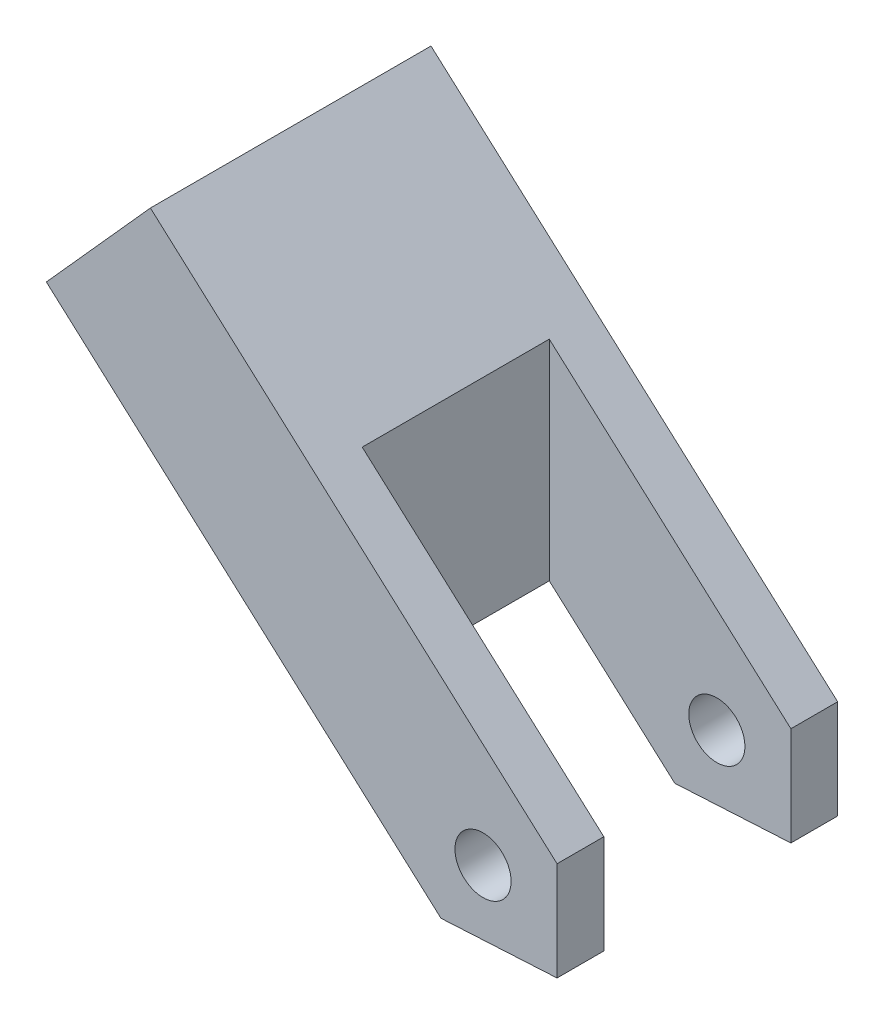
ISO-10303-21;
HEADER;
FILE_DESCRIPTION(('STEP AP214'),'2;1');
FILE_NAME('part.step','',(''),(''),'','','');
FILE_SCHEMA(('AUTOMOTIVE_DESIGN { 1 0 10303 214 1 1 1 1 }'));
ENDSEC;
DATA;
#1=APPLICATION_CONTEXT('core data for automotive mechanical design processes');
#2=APPLICATION_PROTOCOL_DEFINITION('international standard','automotive_design',2000,#1);
#3=PRODUCT_CONTEXT('',#1,'mechanical');
#4=PRODUCT('Part','Part','',(#3));
#5=PRODUCT_RELATED_PRODUCT_CATEGORY('part','',(#4));
#6=PRODUCT_DEFINITION_FORMATION('','',#4);
#7=PRODUCT_DEFINITION_CONTEXT('part definition',#1,'design');
#8=PRODUCT_DEFINITION('design','',#6,#7);
#9=PRODUCT_DEFINITION_SHAPE('','',#8);
#10=(LENGTH_UNIT() NAMED_UNIT(*) SI_UNIT(.MILLI.,.METRE.));
#11=(NAMED_UNIT(*) PLANE_ANGLE_UNIT() SI_UNIT($,.RADIAN.));
#12=(NAMED_UNIT(*) SI_UNIT($,.STERADIAN.) SOLID_ANGLE_UNIT());
#13=UNCERTAINTY_MEASURE_WITH_UNIT(LENGTH_MEASURE(1.E-05),#10,'distance_accuracy_value','');
#14=(GEOMETRIC_REPRESENTATION_CONTEXT(3) GLOBAL_UNCERTAINTY_ASSIGNED_CONTEXT((#13)) GLOBAL_UNIT_ASSIGNED_CONTEXT((#10,
#11,#12)) REPRESENTATION_CONTEXT('',''));
#15=CARTESIAN_POINT('',(0.,0.,0.));
#16=DIRECTION('',(0.,0.,1.));
#17=DIRECTION('',(1.,0.,0.));
#18=AXIS2_PLACEMENT_3D('',#15,#16,#17);
#19=CARTESIAN_POINT('',(16.3815669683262,-14.6848310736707,9.));
#20=DIRECTION('',(-1.,0.,0.));
#21=DIRECTION('',(0.,0.,1.));
#22=AXIS2_PLACEMENT_3D('',#19,#20,#21);
#23=PLANE('',#22);
#24=DIRECTION('',(0.,1.,0.));
#25=VECTOR('',#24,1.);
#26=CARTESIAN_POINT('',(16.3815669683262,-14.6848310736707,9.));
#27=LINE('',#26,#25);
#28=CARTESIAN_POINT('',(16.3815669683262,-11.1440279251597,9.));
#29=VERTEX_POINT('',#28);
#30=CARTESIAN_POINT('',(16.3815669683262,-7.96996672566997,9.));
#31=VERTEX_POINT('',#30);
#32=EDGE_CURVE('E174',#29,#31,#27,.T.);
#33=ORIENTED_EDGE('',*,*,#32,.F.);
#34=DIRECTION('',(0.,0.,-1.));
#35=VECTOR('',#34,1.);
#36=CARTESIAN_POINT('',(16.3815669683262,-11.1440279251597,9.));
#37=LINE('',#36,#35);
#38=CARTESIAN_POINT('',(16.3815669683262,-11.1440279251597,7.5));
#39=VERTEX_POINT('',#38);
#40=EDGE_CURVE('E233',#29,#39,#37,.T.);
#41=ORIENTED_EDGE('',*,*,#40,.T.);
#42=DIRECTION('',(0.,1.,0.));
#43=VECTOR('',#42,1.);
#44=CARTESIAN_POINT('',(16.3815669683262,-14.6848310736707,7.5));
#45=LINE('',#44,#43);
#46=CARTESIAN_POINT('',(16.3815669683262,-7.96996672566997,7.5));
#47=VERTEX_POINT('',#46);
#48=EDGE_CURVE('E137',#39,#47,#45,.T.);
#49=ORIENTED_EDGE('',*,*,#48,.T.);
#50=DIRECTION('',(0.,0.,-1.));
#51=VECTOR('',#50,1.);
#52=CARTESIAN_POINT('',(16.3815669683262,-7.96996672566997,9.));
#53=LINE('',#52,#51);
#54=EDGE_CURVE('E196',#31,#47,#53,.T.);
#55=ORIENTED_EDGE('',*,*,#54,.F.);
#56=EDGE_LOOP('',(#33,#41,#49,#55));
#57=FACE_BOUND('',#56,.T.);
#58=ADVANCED_FACE('F47',(#57),#23,.F.);
#59=CARTESIAN_POINT('',(3.33746160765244,3.72308340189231,9.));
#60=DIRECTION('',(0.744616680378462,-0.667492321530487,0.));
#61=DIRECTION('',(0.667492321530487,0.744616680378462,0.));
#62=AXIS2_PLACEMENT_3D('',#59,#60,#61);
#63=PLANE('',#62);
#64=DIRECTION('',(-0.667492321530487,-0.744616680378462,0.));
#65=VECTOR('',#64,1.);
#66=CARTESIAN_POINT('',(3.33746160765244,3.72308340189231,0.));
#67=LINE('',#66,#65);
#68=CARTESIAN_POINT('',(3.33746160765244,3.72308340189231,0.));
#69=VERTEX_POINT('',#68);
#70=CARTESIAN_POINT('',(0.,0.,0.));
#71=VERTEX_POINT('',#70);
#72=EDGE_CURVE('E165',#69,#71,#67,.T.);
#73=ORIENTED_EDGE('',*,*,#72,.T.);
#74=DIRECTION('',(0.,0.,-1.));
#75=VECTOR('',#74,1.);
#76=CARTESIAN_POINT('',(0.,0.,9.));
#77=LINE('',#76,#75);
#78=CARTESIAN_POINT('',(0.,0.,9.));
#79=VERTEX_POINT('',#78);
#80=EDGE_CURVE('E200',#79,#71,#77,.T.);
#81=ORIENTED_EDGE('',*,*,#80,.F.);
#82=DIRECTION('',(-0.667492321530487,-0.744616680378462,0.));
#83=VECTOR('',#82,1.);
#84=CARTESIAN_POINT('',(3.33746160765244,3.72308340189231,9.));
#85=LINE('',#84,#83);
#86=CARTESIAN_POINT('',(3.33746160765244,3.72308340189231,9.));
#87=VERTEX_POINT('',#86);
#88=EDGE_CURVE('E166',#87,#79,#85,.T.);
#89=ORIENTED_EDGE('',*,*,#88,.F.);
#90=DIRECTION('',(0.,0.,-1.));
#91=VECTOR('',#90,1.);
#92=CARTESIAN_POINT('',(3.33746160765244,3.72308340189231,9.));
#93=LINE('',#92,#91);
#94=EDGE_CURVE('E180',#87,#69,#93,.T.);
#95=ORIENTED_EDGE('',*,*,#94,.T.);
#96=EDGE_LOOP('',(#73,#81,#89,#95));
#97=FACE_BOUND('',#96,.T.);
#98=ADVANCED_FACE('F253',(#97),#63,.F.);
#99=CARTESIAN_POINT('',(0.,0.,9.));
#100=DIRECTION('',(0.667492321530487,0.744616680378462,0.));
#101=DIRECTION('',(-0.744616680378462,0.667492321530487,0.));
#102=AXIS2_PLACEMENT_3D('',#99,#100,#101);
#103=PLANE('',#102);
#104=DIRECTION('',(0.744616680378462,-0.667492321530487,0.));
#105=VECTOR('',#104,1.);
#106=CARTESIAN_POINT('',(0.,0.,0.));
#107=LINE('',#106,#105);
#108=CARTESIAN_POINT('',(12.6584835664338,-11.3473694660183,0.));
#109=VERTEX_POINT('',#108);
#110=EDGE_CURVE('E184',#71,#109,#107,.T.);
#111=ORIENTED_EDGE('',*,*,#110,.T.);
#112=DIRECTION('',(0.,0.,1.));
#113=VECTOR('',#112,1.);
#114=CARTESIAN_POINT('',(12.6584835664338,-11.3473694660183,9.));
#115=LINE('',#114,#113);
#116=CARTESIAN_POINT('',(12.6584835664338,-11.3473694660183,1.5));
#117=VERTEX_POINT('',#116);
#118=EDGE_CURVE('E132',#109,#117,#115,.T.);
#119=ORIENTED_EDGE('',*,*,#118,.T.);
#120=DIRECTION('',(-0.744616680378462,0.667492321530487,0.));
#121=VECTOR('',#120,1.);
#122=CARTESIAN_POINT('',(0.,0.,1.5));
#123=LINE('',#122,#121);
#124=CARTESIAN_POINT('',(8.63156696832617,-7.73754446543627,1.5));
#125=VERTEX_POINT('',#124);
#126=EDGE_CURVE('E125',#117,#125,#123,.T.);
#127=ORIENTED_EDGE('',*,*,#126,.T.);
#128=DIRECTION('',(0.,0.,1.));
#129=VECTOR('',#128,1.);
#130=CARTESIAN_POINT('',(8.63156696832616,-7.73754446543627,9.));
#131=LINE('',#130,#129);
#132=CARTESIAN_POINT('',(8.63156696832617,-7.73754446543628,7.5));
#133=VERTEX_POINT('',#132);
#134=EDGE_CURVE('E130',#125,#133,#131,.T.);
#135=ORIENTED_EDGE('',*,*,#134,.T.);
#136=DIRECTION('',(0.744616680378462,-0.667492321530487,0.));
#137=VECTOR('',#136,1.);
#138=CARTESIAN_POINT('',(0.,0.,7.5));
#139=LINE('',#138,#137);
#140=CARTESIAN_POINT('',(12.6584835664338,-11.3473694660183,7.5));
#141=VERTEX_POINT('',#140);
#142=EDGE_CURVE('E148',#133,#141,#139,.T.);
#143=ORIENTED_EDGE('',*,*,#142,.T.);
#144=DIRECTION('',(0.,0.,1.));
#145=VECTOR('',#144,1.);
#146=CARTESIAN_POINT('',(12.6584835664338,-11.3473694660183,9.));
#147=LINE('',#146,#145);
#148=CARTESIAN_POINT('',(12.6584835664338,-11.3473694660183,9.));
#149=VERTEX_POINT('',#148);
#150=EDGE_CURVE('E225',#141,#149,#147,.T.);
#151=ORIENTED_EDGE('',*,*,#150,.T.);
#152=DIRECTION('',(0.744616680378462,-0.667492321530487,0.));
#153=VECTOR('',#152,1.);
#154=CARTESIAN_POINT('',(0.,0.,9.));
#155=LINE('',#154,#153);
#156=EDGE_CURVE('E170',#79,#149,#155,.T.);
#157=ORIENTED_EDGE('',*,*,#156,.F.);
#158=ORIENTED_EDGE('',*,*,#80,.T.);
#159=EDGE_LOOP('',(#111,#119,#127,#135,#143,#151,#157,#158));
#160=FACE_BOUND('',#159,.T.);
#161=ADVANCED_FACE('F128',(#160),#103,.F.);
#162=DIRECTION('',(0.,1.,0.));
#163=VECTOR('',#162,1.);
#164=CARTESIAN_POINT('',(16.3815669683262,-14.6848310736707,1.5));
#165=LINE('',#164,#163);
#166=CARTESIAN_POINT('',(16.3815669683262,-11.1440279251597,1.5));
#167=VERTEX_POINT('',#166);
#168=CARTESIAN_POINT('',(16.3815669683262,-7.96996672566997,1.5));
#169=VERTEX_POINT('',#168);
#170=EDGE_CURVE('E154',#167,#169,#165,.T.);
#171=ORIENTED_EDGE('',*,*,#170,.F.);
#172=DIRECTION('',(0.,0.,-1.));
#173=VECTOR('',#172,1.);
#174=CARTESIAN_POINT('',(16.3815669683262,-11.1440279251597,9.));
#175=LINE('',#174,#173);
#176=CARTESIAN_POINT('',(16.3815669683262,-11.1440279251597,0.));
#177=VERTEX_POINT('',#176);
#178=EDGE_CURVE('E213',#167,#177,#175,.T.);
#179=ORIENTED_EDGE('',*,*,#178,.T.);
#180=DIRECTION('',(0.,1.,0.));
#181=VECTOR('',#180,1.);
#182=CARTESIAN_POINT('',(16.3815669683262,-14.6848310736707,0.));
#183=LINE('',#182,#181);
#184=CARTESIAN_POINT('',(16.3815669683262,-7.96996672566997,0.));
#185=VERTEX_POINT('',#184);
#186=EDGE_CURVE('E187',#177,#185,#183,.T.);
#187=ORIENTED_EDGE('',*,*,#186,.T.);
#188=EDGE_CURVE('E195',#169,#185,#53,.T.);
#189=ORIENTED_EDGE('',*,*,#188,.F.);
#190=EDGE_LOOP('',(#171,#179,#187,#189));
#191=FACE_BOUND('',#190,.T.);
#192=ADVANCED_FACE('F261',(#191),#23,.F.);
#193=CARTESIAN_POINT('',(16.3815669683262,-7.96996672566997,9.));
#194=DIRECTION('',(-0.667492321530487,-0.744616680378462,0.));
#195=DIRECTION('',(0.744616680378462,-0.667492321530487,0.));
#196=AXIS2_PLACEMENT_3D('',#193,#194,#195);
#197=PLANE('',#196);
#198=ORIENTED_EDGE('',*,*,#54,.T.);
#199=DIRECTION('',(-0.744616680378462,0.667492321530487,0.));
#200=VECTOR('',#199,1.);
#201=CARTESIAN_POINT('',(16.3815669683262,-7.96996672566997,7.5));
#202=LINE('',#201,#200);
#203=CARTESIAN_POINT('',(8.63156696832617,-1.02268011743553,7.5));
#204=VERTEX_POINT('',#203);
#205=EDGE_CURVE('E209',#47,#204,#202,.T.);
#206=ORIENTED_EDGE('',*,*,#205,.T.);
#207=DIRECTION('',(0.,0.,-1.));
#208=VECTOR('',#207,1.);
#209=CARTESIAN_POINT('',(8.63156696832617,-1.02268011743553,9.));
#210=LINE('',#209,#208);
#211=CARTESIAN_POINT('',(8.63156696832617,-1.02268011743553,1.5));
#212=VERTEX_POINT('',#211);
#213=EDGE_CURVE('E206',#204,#212,#210,.T.);
#214=ORIENTED_EDGE('',*,*,#213,.T.);
#215=DIRECTION('',(0.744616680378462,-0.667492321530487,0.));
#216=VECTOR('',#215,1.);
#217=CARTESIAN_POINT('',(16.3815669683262,-7.96996672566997,1.5));
#218=LINE('',#217,#216);
#219=EDGE_CURVE('E152',#212,#169,#218,.T.);
#220=ORIENTED_EDGE('',*,*,#219,.T.);
#221=ORIENTED_EDGE('',*,*,#188,.T.);
#222=DIRECTION('',(-0.744616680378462,0.667492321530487,0.));
#223=VECTOR('',#222,1.);
#224=CARTESIAN_POINT('',(16.3815669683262,-7.96996672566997,0.));
#225=LINE('',#224,#223);
#226=EDGE_CURVE('E171',#185,#69,#225,.T.);
#227=ORIENTED_EDGE('',*,*,#226,.T.);
#228=ORIENTED_EDGE('',*,*,#94,.F.);
#229=DIRECTION('',(-0.744616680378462,0.667492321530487,0.));
#230=VECTOR('',#229,1.);
#231=CARTESIAN_POINT('',(16.3815669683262,-7.96996672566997,9.));
#232=LINE('',#231,#230);
#233=EDGE_CURVE('E177',#31,#87,#232,.T.);
#234=ORIENTED_EDGE('',*,*,#233,.F.);
#235=EDGE_LOOP('',(#198,#206,#214,#220,#221,#227,#228,#234));
#236=FACE_BOUND('',#235,.T.);
#237=ADVANCED_FACE('F248',(#236),#197,.F.);
#238=CARTESIAN_POINT('',(0.,0.,9.));
#239=DIRECTION('',(0.,0.,1.));
#240=DIRECTION('',(1.,0.,0.));
#241=AXIS2_PLACEMENT_3D('',#238,#239,#240);
#242=PLANE('',#241);
#243=CARTESIAN_POINT('',(14.0065669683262,-9.19839171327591,9.));
#244=DIRECTION('',(0.,0.,1.));
#245=DIRECTION('',(1.,0.,0.));
#246=AXIS2_PLACEMENT_3D('',#243,#244,#245);
#247=CIRCLE('',#246,0.899999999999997);
#248=CARTESIAN_POINT('',(14.9065669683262,-9.19839171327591,9.));
#249=VERTEX_POINT('',#248);
#250=EDGE_CURVE('E218',#249,#249,#247,.T.);
#251=ORIENTED_EDGE('',*,*,#250,.F.);
#252=EDGE_LOOP('',(#251));
#253=FACE_BOUND('',#252,.T.);
#254=ORIENTED_EDGE('',*,*,#156,.T.);
#255=DIRECTION('',(-0.998511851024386,-0.0545351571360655,0.));
#256=VECTOR('',#255,1.);
#257=CARTESIAN_POINT('',(0.655557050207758,-12.002926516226,9.));
#258=LINE('',#257,#256);
#259=EDGE_CURVE('E11',#149,#29,#258,.F.);
#260=ORIENTED_EDGE('',*,*,#259,.T.);
#261=ORIENTED_EDGE('',*,*,#32,.T.);
#262=ORIENTED_EDGE('',*,*,#233,.T.);
#263=ORIENTED_EDGE('',*,*,#88,.T.);
#264=EDGE_LOOP('',(#254,#260,#261,#262,#263));
#265=FACE_BOUND('',#264,.T.);
#266=ADVANCED_FACE('F243',(#253,#265),#242,.T.);
#267=CARTESIAN_POINT('',(0.,0.,0.));
#268=DIRECTION('',(0.,0.,1.));
#269=DIRECTION('',(1.,0.,0.));
#270=AXIS2_PLACEMENT_3D('',#267,#268,#269);
#271=PLANE('',#270);
#272=CARTESIAN_POINT('',(14.0065669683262,-9.19839171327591,0.));
#273=DIRECTION('',(0.,0.,1.));
#274=DIRECTION('',(1.,0.,0.));
#275=AXIS2_PLACEMENT_3D('',#272,#273,#274);
#276=CIRCLE('',#275,0.899999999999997);
#277=CARTESIAN_POINT('',(14.9065669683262,-9.19839171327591,0.));
#278=VERTEX_POINT('',#277);
#279=EDGE_CURVE('E269',#278,#278,#276,.T.);
#280=ORIENTED_EDGE('',*,*,#279,.T.);
#281=EDGE_LOOP('',(#280));
#282=FACE_BOUND('',#281,.T.);
#283=ORIENTED_EDGE('',*,*,#186,.F.);
#284=DIRECTION('',(0.998511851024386,0.0545351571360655,0.));
#285=VECTOR('',#284,1.);
#286=CARTESIAN_POINT('',(16.3815669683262,-11.1440279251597,0.));
#287=LINE('',#286,#285);
#288=EDGE_CURVE('E222',#177,#109,#287,.F.);
#289=ORIENTED_EDGE('',*,*,#288,.T.);
#290=ORIENTED_EDGE('',*,*,#110,.F.);
#291=ORIENTED_EDGE('',*,*,#72,.F.);
#292=ORIENTED_EDGE('',*,*,#226,.F.);
#293=EDGE_LOOP('',(#283,#289,#290,#291,#292));
#294=FACE_BOUND('',#293,.T.);
#295=ADVANCED_FACE('F281',(#282,#294),#271,.F.);
#296=CARTESIAN_POINT('',(16.3815669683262,-14.6848310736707,7.5));
#297=DIRECTION('',(0.,0.,1.));
#298=DIRECTION('',(1.,0.,0.));
#299=AXIS2_PLACEMENT_3D('',#296,#297,#298);
#300=PLANE('',#299);
#301=CARTESIAN_POINT('',(14.0065669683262,-9.19839171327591,7.5));
#302=DIRECTION('',(0.,0.,1.));
#303=DIRECTION('',(1.,0.,0.));
#304=AXIS2_PLACEMENT_3D('',#301,#302,#303);
#305=CIRCLE('',#304,0.899999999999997);
#306=CARTESIAN_POINT('',(14.9065669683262,-9.19839171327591,7.5));
#307=VERTEX_POINT('',#306);
#308=EDGE_CURVE('E159',#307,#307,#305,.F.);
#309=ORIENTED_EDGE('',*,*,#308,.F.);
#310=EDGE_LOOP('',(#309));
#311=FACE_BOUND('',#310,.T.);
#312=ORIENTED_EDGE('',*,*,#48,.F.);
#313=DIRECTION('',(0.998511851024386,0.0545351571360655,0.));
#314=VECTOR('',#313,1.);
#315=CARTESIAN_POINT('',(16.3815669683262,-11.1440279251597,7.5));
#316=LINE('',#315,#314);
#317=EDGE_CURVE('E57',#39,#141,#316,.F.);
#318=ORIENTED_EDGE('',*,*,#317,.T.);
#319=ORIENTED_EDGE('',*,*,#142,.F.);
#320=DIRECTION('',(0.,1.,0.));
#321=VECTOR('',#320,1.);
#322=CARTESIAN_POINT('',(8.63156696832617,-14.6848310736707,7.5));
#323=LINE('',#322,#321);
#324=EDGE_CURVE('E146',#133,#204,#323,.T.);
#325=ORIENTED_EDGE('',*,*,#324,.T.);
#326=ORIENTED_EDGE('',*,*,#205,.F.);
#327=EDGE_LOOP('',(#312,#318,#319,#325,#326));
#328=FACE_BOUND('',#327,.T.);
#329=ADVANCED_FACE('F238',(#311,#328),#300,.F.);
#330=CARTESIAN_POINT('',(8.63156696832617,-14.6848310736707,1.5));
#331=DIRECTION('',(-1.,0.,0.));
#332=DIRECTION('',(0.,0.,1.));
#333=AXIS2_PLACEMENT_3D('',#330,#331,#332);
#334=PLANE('',#333);
#335=DIRECTION('',(0.,1.,0.));
#336=VECTOR('',#335,1.);
#337=CARTESIAN_POINT('',(8.63156696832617,-14.6848310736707,1.5));
#338=LINE('',#337,#336);
#339=EDGE_CURVE('E143',#125,#212,#338,.T.);
#340=ORIENTED_EDGE('',*,*,#339,.T.);
#341=ORIENTED_EDGE('',*,*,#213,.F.);
#342=ORIENTED_EDGE('',*,*,#324,.F.);
#343=ORIENTED_EDGE('',*,*,#134,.F.);
#344=EDGE_LOOP('',(#340,#341,#342,#343));
#345=FACE_BOUND('',#344,.T.);
#346=ADVANCED_FACE('F142',(#345),#334,.F.);
#347=CARTESIAN_POINT('',(16.3815669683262,-14.6848310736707,1.5));
#348=DIRECTION('',(0.,0.,-1.));
#349=DIRECTION('',(-1.,0.,0.));
#350=AXIS2_PLACEMENT_3D('',#347,#348,#349);
#351=PLANE('',#350);
#352=CARTESIAN_POINT('',(14.0065669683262,-9.19839171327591,1.5));
#353=DIRECTION('',(0.,0.,-1.));
#354=DIRECTION('',(-1.,0.,0.));
#355=AXIS2_PLACEMENT_3D('',#352,#353,#354);
#356=CIRCLE('',#355,0.899999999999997);
#357=CARTESIAN_POINT('',(13.1065669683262,-9.19839171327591,1.5));
#358=VERTEX_POINT('',#357);
#359=EDGE_CURVE('E214',#358,#358,#356,.F.);
#360=ORIENTED_EDGE('',*,*,#359,.F.);
#361=EDGE_LOOP('',(#360));
#362=FACE_BOUND('',#361,.T.);
#363=ORIENTED_EDGE('',*,*,#126,.F.);
#364=DIRECTION('',(-0.998511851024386,-0.0545351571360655,0.));
#365=VECTOR('',#364,1.);
#366=CARTESIAN_POINT('',(16.3815669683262,-11.1440279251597,1.5));
#367=LINE('',#366,#365);
#368=EDGE_CURVE('E230',#117,#167,#367,.F.);
#369=ORIENTED_EDGE('',*,*,#368,.T.);
#370=ORIENTED_EDGE('',*,*,#170,.T.);
#371=ORIENTED_EDGE('',*,*,#219,.F.);
#372=ORIENTED_EDGE('',*,*,#339,.F.);
#373=EDGE_LOOP('',(#363,#369,#370,#371,#372));
#374=FACE_BOUND('',#373,.T.);
#375=ADVANCED_FACE('F150',(#362,#374),#351,.F.);
#376=CARTESIAN_POINT('',(14.0065669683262,-9.19839171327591,9.));
#377=DIRECTION('',(0.,0.,-1.));
#378=DIRECTION('',(-1.,0.,0.));
#379=AXIS2_PLACEMENT_3D('',#376,#377,#378);
#380=CYLINDRICAL_SURFACE('',#379,0.899999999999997);
#381=ORIENTED_EDGE('',*,*,#279,.F.);
#382=EDGE_LOOP('',(#381));
#383=FACE_BOUND('',#382,.T.);
#384=ORIENTED_EDGE('',*,*,#359,.T.);
#385=EDGE_LOOP('',(#384));
#386=FACE_BOUND('',#385,.T.);
#387=ADVANCED_FACE('F313',(#383,#386),#380,.F.);
#388=ORIENTED_EDGE('',*,*,#250,.T.);
#389=EDGE_LOOP('',(#388));
#390=FACE_BOUND('',#389,.T.);
#391=ORIENTED_EDGE('',*,*,#308,.T.);
#392=EDGE_LOOP('',(#391));
#393=FACE_BOUND('',#392,.T.);
#394=ADVANCED_FACE('F277',(#390,#393),#380,.F.);
#395=CARTESIAN_POINT('',(16.3815669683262,-11.1440279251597,9.));
#396=DIRECTION('',(-0.0545351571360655,0.998511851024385,0.));
#397=DIRECTION('',(0.,0.,-1.));
#398=AXIS2_PLACEMENT_3D('',#395,#396,#397);
#399=PLANE('',#398);
#400=ORIENTED_EDGE('',*,*,#368,.F.);
#401=ORIENTED_EDGE('',*,*,#118,.F.);
#402=ORIENTED_EDGE('',*,*,#288,.F.);
#403=ORIENTED_EDGE('',*,*,#178,.F.);
#404=EDGE_LOOP('',(#400,#401,#402,#403));
#405=FACE_BOUND('',#404,.T.);
#406=ADVANCED_FACE('F256',(#405),#399,.F.);
#407=CARTESIAN_POINT('',(16.3815669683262,-11.1440279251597,9.));
#408=DIRECTION('',(-0.0545351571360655,0.998511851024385,0.));
#409=DIRECTION('',(0.,0.,-1.));
#410=AXIS2_PLACEMENT_3D('',#407,#408,#409);
#411=PLANE('',#410);
#412=ORIENTED_EDGE('',*,*,#259,.F.);
#413=ORIENTED_EDGE('',*,*,#150,.F.);
#414=ORIENTED_EDGE('',*,*,#317,.F.);
#415=ORIENTED_EDGE('',*,*,#40,.F.);
#416=EDGE_LOOP('',(#412,#413,#414,#415));
#417=FACE_BOUND('',#416,.T.);
#418=ADVANCED_FACE('F50',(#417),#411,.F.);
#419=CLOSED_SHELL('',(#58,#98,#161,#192,#237,#266,#295,#329,#346,#375,#387,#394,#406,#418));
#420=MANIFOLD_SOLID_BREP('B2',#419);
#421=ADVANCED_BREP_SHAPE_REPRESENTATION('',(#18,#420),#14);
#422=SHAPE_DEFINITION_REPRESENTATION(#9,#421);
ENDSEC;
END-ISO-10303-21;
